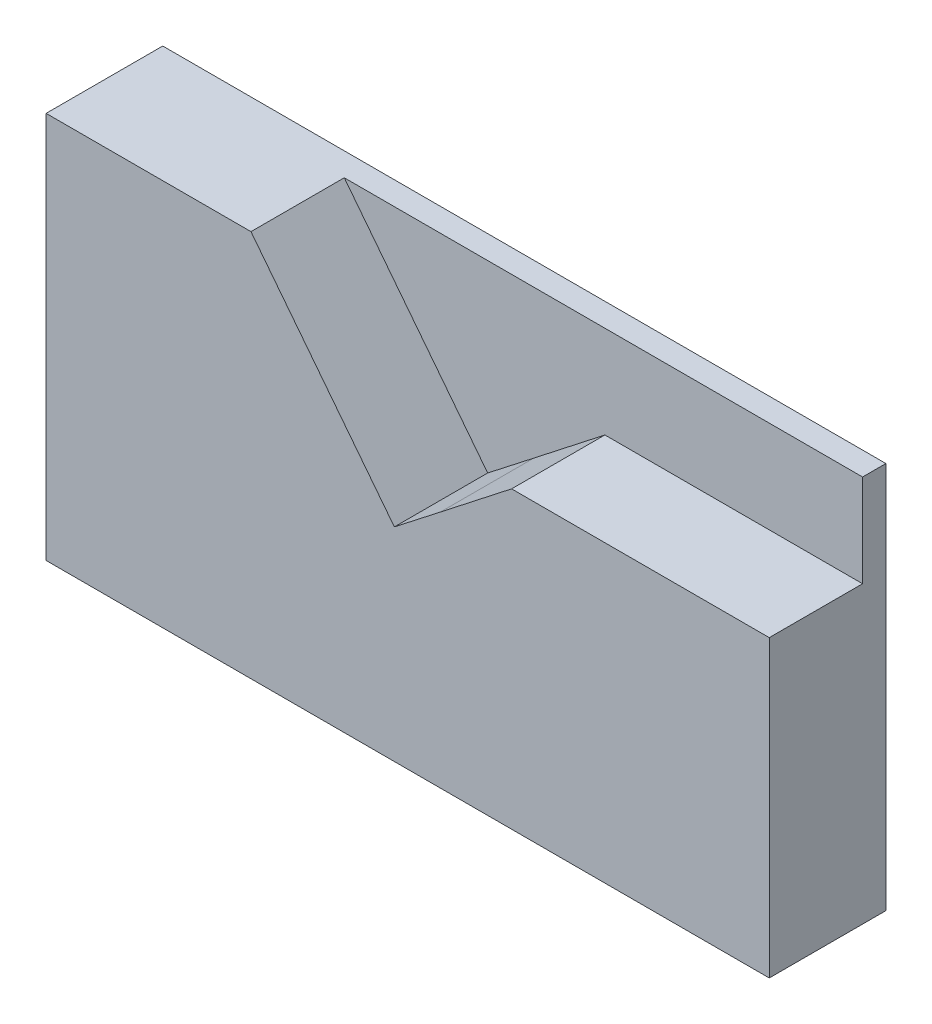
from build123d import *

# Parameters (mm, degrees)
SKETCH1_W          = 39.37
SKETCH1_H          = 21.082
EXTRUDE1_DEPTH     = 6.35
CUT_EXTRUDE1_DEPTH = 5.08


with BuildPart() as part:
    # Sketch1 → Extrude1 (new body)
    with BuildSketch(Plane.XY):
        with Locations((-19.685, 10.541)):
            Rectangle(SKETCH1_W, SKETCH1_H)
    extrude(amount=EXTRUDE1_DEPTH)

    # Sketch2 → Cut-Extrude1 (cut)
    with BuildSketch(Plane.XY.offset(6.35)):
        Polygon((0, 16.048569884), (0, 21.082), (-28.216693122, 21.082), (-20.410413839, 11.064415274), (-17.906017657, 13.015985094), (-14.027760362, 16.048569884), align=None)
    extrude(amount=-CUT_EXTRUDE1_DEPTH, mode=Mode.SUBTRACT)


solid = part.part
